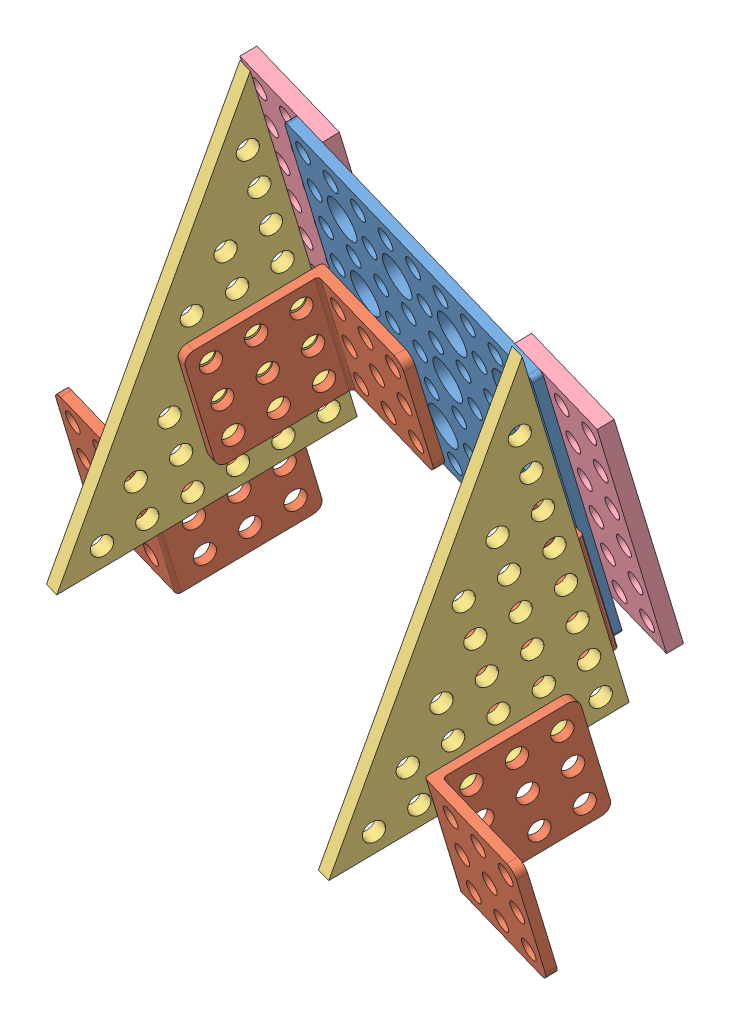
SolidWorks assembly 保护板支架.SLDASM, configuration 默认 (file format 10000). Lengths in mm.
Overall size (136.91 99.98 94.79).
9 component instances, 4 part files, 17 mates.
Components (placement in the parent):
- 72mm X 56mm 板-1: 72mm X 56mm 板.SLDPRT [默认] at (40.767 53.408 190.106) x (0.967162 -0.03906 0.251142) z (0.252233 0.268989 -0.929528) size (72 56 2)
- 搞了半天的90度折角件-1: 搞了半天的90度折角件.SLDPRT [默认] at (-65.4452 -28.8107 176.2214) x (0.967162 -0.03906 0.251142) z (-0.031247 0.962351 0.270008) size (26 26 24)
- 三角板-1: 三角板.SLDPRT [默认] at (-40.0719 44.8111 205.4301) x (-0.031247 0.962351 0.270008) z (-0.252233 -0.268989 0.929528) size (74 3 53)
- 搞了半天的90度折角件-2: 搞了半天的90度折角件.SLDPRT [默认] at (-3.9069 1.3912 162.9308) x (-0.967162 0.03906 -0.251142) z (-0.031247 0.962351 0.270008) size (26 26 24)
- 6x3-1: 6x3.SLDPRT [默认] at (-30.3804 31.5951 162.3359) x (-0.031247 0.962351 0.270008) z (-0.967162 0.03906 -0.251142) size (48 3 24)
- 6x3-2: 6x3.SLDPRT [默认] at (46.9926 28.4703 182.4272) x (-0.031247 0.962351 0.270008) z (-0.967162 0.03906 -0.251142) size (48 3 24)
- 搞了半天的90度折角件-3: 搞了半天的90度折角件.SLDPRT [默认] at (18.5551 23.5502 175.4384) x (0.967162 -0.03906 0.251142) z (0.031247 -0.962351 -0.270008) size (26 26 24)
- 三角板-2: 三角板.SLDPRT [默认] at (36.3479 41.2955 225.1497) x (-0.031247 0.962351 0.270008) z (-0.252233 -0.268989 0.929528) size (74 3 53)
- 搞了半天的90度折角件-4: 搞了半天的90度折角件.SLDPRT [默认] at (63.4046 -10.9483 216.3546) x (-0.967162 0.03906 -0.251142) z (0.031247 -0.962351 -0.270008) size (26 26 24)
Mates (geometry in assembly coordinates):
- 重合3: coincident aligned: circle of 搞了半天的90度折角件-1; circle of 三角板-1
- 平行2: parallel anti-aligned: line of 搞了半天的90度折角件-1 through (-35.7377 -20.8297 158.6211) axis (-0.031247 0.962351 0.270008); line of 三角板-1 through (-34.5353 65.931 175.4479) axis (0.031247 -0.962351 -0.270008)
- 重合5: coincident anti-aligned: circle of 三角板-1; circle of 搞了半天的90度折角件-2
- 平行3: parallel anti-aligned: line of 三角板-1 through (-31.6338 65.8138 176.2013) axis (0.031247 -0.962351 -0.270008); line of 搞了半天的90度折角件-2 through (-27.7998 1.6023 159.4131) axis (-0.031247 0.962351 0.270008)
- 重合9: coincident anti-aligned: circle of 72mm X 56mm 板-1; circle of 搞了半天的90度折角件-2
- 平行5: parallel anti-aligned: line of 72mm X 56mm 板-1 through (42.0542 0.0934 172.8754) axis (-0.967162 0.03906 -0.251142); line of 搞了半天的90度折角件-2 through (-26.9462 1.7633 158.9382) axis (0.967162 -0.03906 0.251142)
- 重合11: coincident aligned: circle of 72mm X 56mm 板-1; circle of 6x3-1
- 平行6: parallel anti-aligned: line of 72mm X 56mm 板-1 through (-26.6455 3.8289 155.3143) axis (-0.031247 0.962351 0.270008); line of 6x3-1 through (-19.8701 57.2527 169.3853) axis (0.031247 -0.962351 -0.270008)
- 重合13: coincident aligned: circle of 72mm X 56mm 板-1; circle of 6x3-2
- 平行7: parallel anti-aligned: line of 72mm X 56mm 板-1 through (41.3028 52.9836 187.977) axis (0.031247 -0.962351 -0.270008); line of 6x3-2 through (35.7908 8.8725 170.4889) axis (-0.031247 0.962351 0.270008)
- 平行8: parallel aligned: line of 72mm X 56mm 板-1 through (40.7983 52.4456 189.836) axis (0.031247 -0.962351 -0.270008); line of 搞了半天的90度折角件-3 through (18.1131 21.0875 176.7574) axis (0.031247 -0.962351 -0.270008)
- 同心1: concentric anti-aligned: circle of 72mm X 56mm 板-1; circle of 搞了半天的90度折角件-3
- 重合18: coincident anti-aligned: plane of 72mm X 56mm 板-1 through (40.767 53.408 190.106) normal (-0.252233 -0.268989 0.929528); plane of 搞了半天的90度折角件-3 through (18.5551 23.5502 175.4384) normal (0.252233 0.268989 -0.929528)
- 重合20: coincident aligned: circle of 搞了半天的90度折角件-3; circle of 三角板-2
- 平行10: parallel aligned: line of 6x3-2 through (59.0027 7.9351 176.5163) axis (-0.252233 -0.268989 0.929528); line of 三角板-2 through (47.0982 -8.9158 175.9403) axis (-0.252233 -0.268989 0.929528)
- 重合22: coincident: circle of 三角板-2; circle of 搞了半天的90度折角件-4
- 平行11: parallel aligned: line of 三角板-2 through (47.0982 -8.9158 175.9403) axis (-0.252233 -0.268989 0.929528); line of 搞了半天的90度折角件-4 through (46.9962 -26.6515 181.5383) axis (-0.252233 -0.268989 0.929528)
